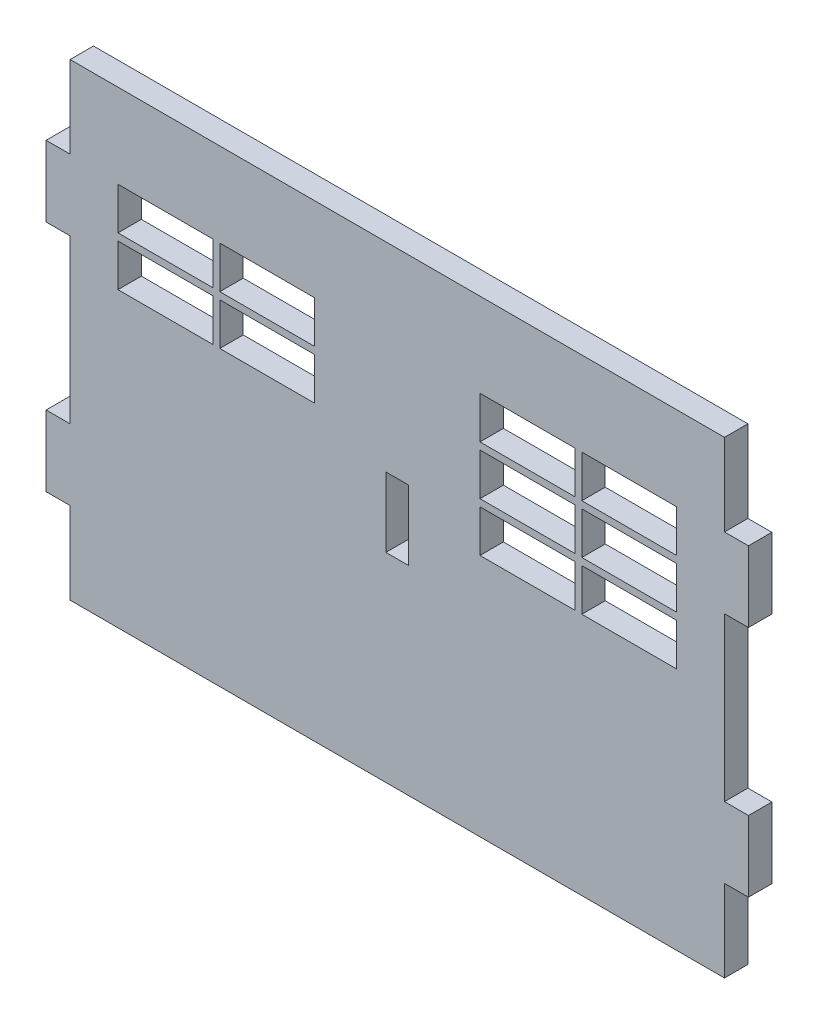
from build123d import *

# Parameters (mm, degrees)
LATERALE1_W         = 40.5
LATERALE1_H         = 18
LATERALE1_W_2       = 9.76
LATERALE1_H_2       = 29.76
BOSS_EXTRUDE1_DEPTH = 10


with BuildPart() as part:
    # Laterale1 → Boss-Extrude1 (new body)
    with BuildSketch(Plane.XY):
        Polygon((-76.716521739, 69.875776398), (202.803478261, 69.875776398), (202.803478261, 34.875776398), (213.043478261, 34.875776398), (213.043478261, 4.635776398), (202.803478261, 4.635776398), (202.803478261, -64.884223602), (213.043478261, -64.884223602), (213.043478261, -95.124223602), (202.803478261, -95.124223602), (202.803478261, -130.124223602), (-76.716521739, -130.124223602), (-76.716521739, -95.124223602), (-86.956521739, -95.124223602), (-86.956521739, -64.884223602), (-76.716521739, -64.884223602), (-76.716521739, 4.635776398), (-86.956521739, 4.635776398), (-86.956521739, 34.875776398), (-76.716521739, 34.875776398), align=None)
        with Locations((-36.025668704, 24.96251743)):
            Rectangle(LATERALE1_W, LATERALE1_H, mode=Mode.SUBTRACT)
        with Locations((7.474331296, 24.96251743)):
            Rectangle(LATERALE1_W, LATERALE1_H, mode=Mode.SUBTRACT)
        with Locations((-36.025668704, 3.96251743)):
            Rectangle(LATERALE1_W, LATERALE1_H, mode=Mode.SUBTRACT)
        with Locations((7.474331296, 3.96251743)):
            Rectangle(LATERALE1_W, LATERALE1_H, mode=Mode.SUBTRACT)
        with Locations((118.612625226, 3.96251743)):
            Rectangle(LATERALE1_W, LATERALE1_H, mode=Mode.SUBTRACT)
        with Locations((118.612625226, -17.03748257)):
            Rectangle(LATERALE1_W, LATERALE1_H, mode=Mode.SUBTRACT)
        with Locations((118.612625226, 24.96251743)):
            Rectangle(LATERALE1_W, LATERALE1_H, mode=Mode.SUBTRACT)
        with Locations((162.112625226, 3.96251743)):
            Rectangle(LATERALE1_W, LATERALE1_H, mode=Mode.SUBTRACT)
        with Locations((162.112625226, -17.03748257)):
            Rectangle(LATERALE1_W, LATERALE1_H, mode=Mode.SUBTRACT)
        with Locations((162.112625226, 24.96251743)):
            Rectangle(LATERALE1_W, LATERALE1_H, mode=Mode.SUBTRACT)
        with Locations((63.043478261, -30.124223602)):
            Rectangle(LATERALE1_W_2, LATERALE1_H_2, mode=Mode.SUBTRACT)
    extrude(amount=BOSS_EXTRUDE1_DEPTH)


solid = part.part
